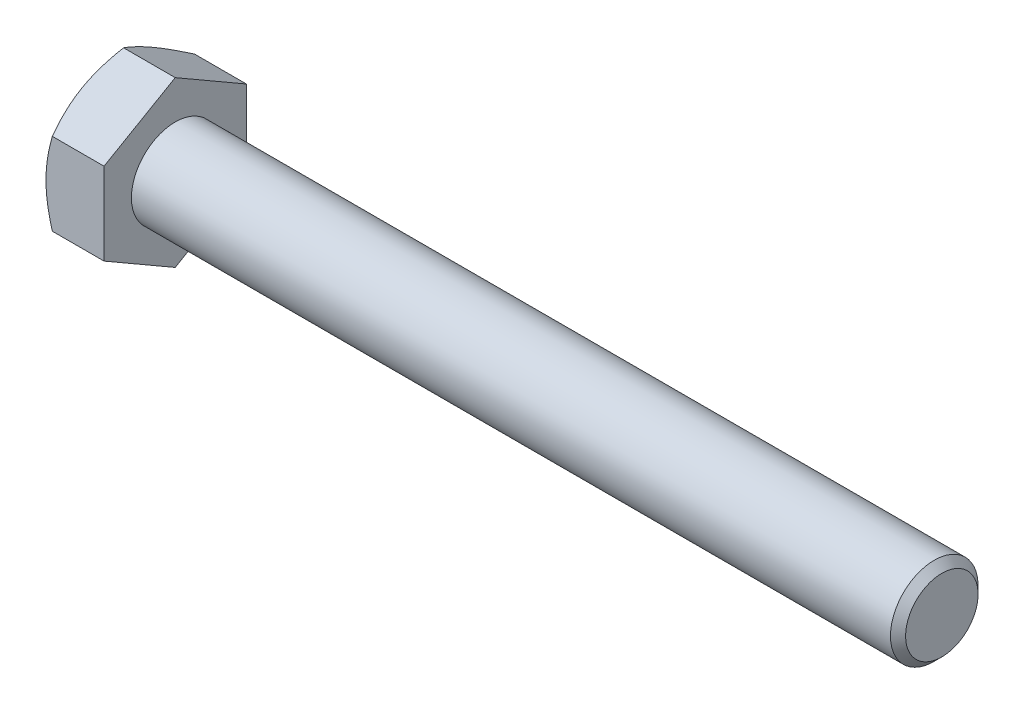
ISO-10303-21;
HEADER;
FILE_DESCRIPTION(('STEP AP214'),'2;1');
FILE_NAME('part.step','',(''),(''),'','','');
FILE_SCHEMA(('AUTOMOTIVE_DESIGN { 1 0 10303 214 1 1 1 1 }'));
ENDSEC;
DATA;
#1=APPLICATION_CONTEXT('core data for automotive mechanical design processes');
#2=APPLICATION_PROTOCOL_DEFINITION('international standard','automotive_design',2000,#1);
#3=PRODUCT_CONTEXT('',#1,'mechanical');
#4=PRODUCT('Part','Part','',(#3));
#5=PRODUCT_RELATED_PRODUCT_CATEGORY('part','',(#4));
#6=PRODUCT_DEFINITION_FORMATION('','',#4);
#7=PRODUCT_DEFINITION_CONTEXT('part definition',#1,'design');
#8=PRODUCT_DEFINITION('design','',#6,#7);
#9=PRODUCT_DEFINITION_SHAPE('','',#8);
#10=(LENGTH_UNIT() NAMED_UNIT(*) SI_UNIT(.MILLI.,.METRE.));
#11=(NAMED_UNIT(*) PLANE_ANGLE_UNIT() SI_UNIT($,.RADIAN.));
#12=(NAMED_UNIT(*) SI_UNIT($,.STERADIAN.) SOLID_ANGLE_UNIT());
#13=UNCERTAINTY_MEASURE_WITH_UNIT(LENGTH_MEASURE(1.E-05),#10,'distance_accuracy_value','');
#14=(GEOMETRIC_REPRESENTATION_CONTEXT(3) GLOBAL_UNCERTAINTY_ASSIGNED_CONTEXT((#13)) GLOBAL_UNIT_ASSIGNED_CONTEXT((#10,
#11,#12)) REPRESENTATION_CONTEXT('',''));
#15=CARTESIAN_POINT('',(0.,0.,0.));
#16=DIRECTION('',(0.,0.,1.));
#17=DIRECTION('',(1.,0.,0.));
#18=AXIS2_PLACEMENT_3D('',#15,#16,#17);
#19=CARTESIAN_POINT('',(5.3,3.75277674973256,-6.5));
#20=DIRECTION('',(0.,-0.866025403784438,0.500000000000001));
#21=DIRECTION('',(0.,-0.500000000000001,-0.866025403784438));
#22=AXIS2_PLACEMENT_3D('',#19,#20,#21);
#23=PLANE('',#22);
#24=CARTESIAN_POINT('',(0.580623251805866,7.50566896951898,0.0002));
#25=CARTESIAN_POINT('',(0.533004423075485,7.4231786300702,-0.14267745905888));
#26=CARTESIAN_POINT('',(0.487546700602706,7.34038072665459,-0.286087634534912));
#27=CARTESIAN_POINT('',(0.401548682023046,7.17411251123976,-0.574072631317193));
#28=CARTESIAN_POINT('',(0.361010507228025,7.09064192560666,-0.718647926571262));
#29=CARTESIAN_POINT('',(0.247571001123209,6.83889369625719,-1.15468865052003));
#30=CARTESIAN_POINT('',(0.183047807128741,6.66962231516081,-1.44787528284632));
#31=CARTESIAN_POINT('',(0.107386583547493,6.41631077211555,-1.88662374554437));
#32=CARTESIAN_POINT('',(0.085832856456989,6.33302748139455,-2.03087463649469));
#33=CARTESIAN_POINT('',(0.0496903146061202,6.16608458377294,-2.32002821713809));
#34=CARTESIAN_POINT('',(0.0351008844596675,6.08242501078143,-2.46493084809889));
#35=CARTESIAN_POINT('',(0.0132587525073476,5.91496056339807,-2.75498777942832));
#36=CARTESIAN_POINT('',(0.00599772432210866,5.8311559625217,-2.90014160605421));
#37=CARTESIAN_POINT('',(-0.00103969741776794,5.66347396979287,-3.19057533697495));
#38=CARTESIAN_POINT('',(-0.000816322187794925,5.5795965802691,-3.33585523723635));
#39=CARTESIAN_POINT('',(0.010083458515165,5.34979921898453,-3.73387594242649));
#40=CARTESIAN_POINT('',(0.0283818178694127,5.20395446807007,-3.98648646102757));
#41=CARTESIAN_POINT('',(0.0864063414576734,4.91323365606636,-4.49002967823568));
#42=CARTESIAN_POINT('',(0.126152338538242,4.76835861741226,-4.74096060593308));
#43=CARTESIAN_POINT('',(0.225505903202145,4.47705272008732,-5.24551722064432));
#44=CARTESIAN_POINT('',(0.285534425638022,4.33065861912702,-5.49907924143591));
#45=CARTESIAN_POINT('',(0.421774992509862,4.04005357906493,-6.00242193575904));
#46=CARTESIAN_POINT('',(0.497955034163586,3.89583891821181,-6.25220905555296));
#47=CARTESIAN_POINT('',(0.58062325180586,3.75266127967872,-6.5002));
#48=B_SPLINE_CURVE_WITH_KNOTS('',3,(#24,#25,#26,#27,#28,#29,#30,#31,#32,#33,#34,#35,#36,#37,#38,
#39,#40,#41,#42,#43,#44,#45,#46,#47),.UNSPECIFIED.,.F.,.F.,(4,2,2,2,2,2,2,2,2,2,2,4),(0.,
0.515105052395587,1.03043143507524,2.06322554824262,2.56697389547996,3.07067772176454,
3.57380860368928,4.0769239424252,4.9527935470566,5.82947446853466,6.72559912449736,
7.61996451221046),.UNSPECIFIED.);
#49=CARTESIAN_POINT('',(0.580556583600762,7.50555349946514,0.));
#50=VERTEX_POINT('',#49);
#51=CARTESIAN_POINT('',(0.,5.62916512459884,-3.25000000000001));
#52=VERTEX_POINT('',#51);
#53=EDGE_CURVE('E54',#50,#52,#48,.T.);
#54=ORIENTED_EDGE('',*,*,#53,.F.);
#55=DIRECTION('',(-1.,0.,0.));
#56=VECTOR('',#55,1.);
#57=CARTESIAN_POINT('',(5.3,7.50555349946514,0.));
#58=LINE('',#57,#56);
#59=CARTESIAN_POINT('',(5.3,7.50555349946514,0.));
#60=VERTEX_POINT('',#59);
#61=EDGE_CURVE('E150',#60,#50,#58,.T.);
#62=ORIENTED_EDGE('',*,*,#61,.F.);
#63=DIRECTION('',(0.,0.500000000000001,0.866025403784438));
#64=VECTOR('',#63,1.);
#65=CARTESIAN_POINT('',(5.3,3.75277674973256,-6.5));
#66=LINE('',#65,#64);
#67=CARTESIAN_POINT('',(5.3,3.75277674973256,-6.5));
#68=VERTEX_POINT('',#67);
#69=EDGE_CURVE('E235',#68,#60,#66,.T.);
#70=ORIENTED_EDGE('',*,*,#69,.F.);
#71=DIRECTION('',(-1.,0.,0.));
#72=VECTOR('',#71,1.);
#73=CARTESIAN_POINT('',(5.3,3.75277674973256,-6.5));
#74=LINE('',#73,#72);
#75=CARTESIAN_POINT('',(0.580556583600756,3.75277674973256,-6.5));
#76=VERTEX_POINT('',#75);
#77=EDGE_CURVE('E138',#68,#76,#74,.T.);
#78=ORIENTED_EDGE('',*,*,#77,.T.);
#79=EDGE_CURVE('E132',#52,#76,#48,.T.);
#80=ORIENTED_EDGE('',*,*,#79,.F.);
#81=EDGE_LOOP('',(#54,#62,#70,#78,#80));
#82=FACE_BOUND('',#81,.T.);
#83=ADVANCED_FACE('F38',(#82),#23,.F.);
#84=CARTESIAN_POINT('',(5.3,7.50555349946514,0.));
#85=DIRECTION('',(0.,-0.866025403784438,-0.500000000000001));
#86=DIRECTION('',(0.,0.500000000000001,-0.866025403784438));
#87=AXIS2_PLACEMENT_3D('',#84,#85,#86);
#88=PLANE('',#87);
#89=CARTESIAN_POINT('',(0.580623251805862,3.75266127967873,6.5002));
#90=CARTESIAN_POINT('',(0.53300442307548,3.83515161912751,6.35732254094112));
#91=CARTESIAN_POINT('',(0.487546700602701,3.91794952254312,6.21391236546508));
#92=CARTESIAN_POINT('',(0.401548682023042,4.08421773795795,5.9259273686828));
#93=CARTESIAN_POINT('',(0.361010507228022,4.16768832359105,5.78135207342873));
#94=CARTESIAN_POINT('',(0.247571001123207,4.41943655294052,5.34531134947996));
#95=CARTESIAN_POINT('',(0.183047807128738,4.5887079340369,5.05212471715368));
#96=CARTESIAN_POINT('',(0.107386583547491,4.84201947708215,4.61337625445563));
#97=CARTESIAN_POINT('',(0.085832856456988,4.92530276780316,4.46912536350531));
#98=CARTESIAN_POINT('',(0.0496903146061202,5.09224566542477,4.17997178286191));
#99=CARTESIAN_POINT('',(0.035100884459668,5.17590523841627,4.03506915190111));
#100=CARTESIAN_POINT('',(0.0132587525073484,5.34336968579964,3.74501222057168));
#101=CARTESIAN_POINT('',(0.00599772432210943,5.427174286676,3.59985839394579));
#102=CARTESIAN_POINT('',(-0.00103969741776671,5.59485627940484,3.30942466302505));
#103=CARTESIAN_POINT('',(-0.000816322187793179,5.6787336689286,3.16414476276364));
#104=CARTESIAN_POINT('',(0.0100834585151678,5.90853103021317,2.76612405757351));
#105=CARTESIAN_POINT('',(0.0283818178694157,6.05437578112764,2.51351353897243));
#106=CARTESIAN_POINT('',(0.0864063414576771,6.34509659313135,2.00997032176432));
#107=CARTESIAN_POINT('',(0.126152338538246,6.48997163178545,1.75903939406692));
#108=CARTESIAN_POINT('',(0.225505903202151,6.78127752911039,1.25448277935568));
#109=CARTESIAN_POINT('',(0.285534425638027,6.92767163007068,1.00092075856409));
#110=CARTESIAN_POINT('',(0.421774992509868,7.21827667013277,0.497578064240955));
#111=CARTESIAN_POINT('',(0.497955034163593,7.36249133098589,0.247790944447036));
#112=CARTESIAN_POINT('',(0.580623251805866,7.50566896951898,-0.000200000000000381));
#113=B_SPLINE_CURVE_WITH_KNOTS('',3,(#89,#90,#91,#92,#93,#94,#95,#96,#97,#98,#99,#100,#101,#102,
#103,#104,#105,#106,#107,#108,#109,#110,#111,#112),.UNSPECIFIED.,.F.,.F.,(4,2,2,2,2,2,2,2,2,2,2,
4),(0.,0.515105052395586,1.03043143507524,2.06322554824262,2.56697389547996,3.07067772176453,
3.57380860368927,4.07692394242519,4.9527935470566,5.82947446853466,6.72559912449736,
7.61996451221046),.UNSPECIFIED.);
#114=CARTESIAN_POINT('',(0.580556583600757,3.75277674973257,6.5));
#115=VERTEX_POINT('',#114);
#116=CARTESIAN_POINT('',(0.,5.62916512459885,3.25));
#117=VERTEX_POINT('',#116);
#118=EDGE_CURVE('E61',#115,#117,#113,.T.);
#119=ORIENTED_EDGE('',*,*,#118,.F.);
#120=DIRECTION('',(-1.,0.,0.));
#121=VECTOR('',#120,1.);
#122=CARTESIAN_POINT('',(5.3,3.75277674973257,6.5));
#123=LINE('',#122,#121);
#124=CARTESIAN_POINT('',(5.3,3.75277674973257,6.5));
#125=VERTEX_POINT('',#124);
#126=EDGE_CURVE('E148',#125,#115,#123,.T.);
#127=ORIENTED_EDGE('',*,*,#126,.F.);
#128=DIRECTION('',(0.,-0.500000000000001,0.866025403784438));
#129=VECTOR('',#128,1.);
#130=CARTESIAN_POINT('',(5.3,7.50555349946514,0.));
#131=LINE('',#130,#129);
#132=EDGE_CURVE('E233',#60,#125,#131,.T.);
#133=ORIENTED_EDGE('',*,*,#132,.F.);
#134=ORIENTED_EDGE('',*,*,#61,.T.);
#135=EDGE_CURVE('E165',#117,#50,#113,.T.);
#136=ORIENTED_EDGE('',*,*,#135,.F.);
#137=EDGE_LOOP('',(#119,#127,#133,#134,#136));
#138=FACE_BOUND('',#137,.T.);
#139=ADVANCED_FACE('F171',(#138),#88,.F.);
#140=CARTESIAN_POINT('',(5.3,3.75277674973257,6.5));
#141=DIRECTION('',(0.,0.,-1.));
#142=DIRECTION('',(0.,1.,0.));
#143=AXIS2_PLACEMENT_3D('',#140,#141,#142);
#144=PLANE('',#143);
#145=CARTESIAN_POINT('',(3.18835311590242,-10.1137456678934,6.5));
#146=CARTESIAN_POINT('',(3.05034774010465,-9.82952666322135,6.5));
#147=CARTESIAN_POINT('',(2.91365616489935,-9.54465869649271,6.5));
#148=CARTESIAN_POINT('',(2.64363899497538,-8.97327978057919,6.5));
#149=CARTESIAN_POINT('',(2.51031392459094,-8.6867685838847,6.5));
#150=CARTESIAN_POINT('',(2.24710473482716,-8.11029837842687,6.5));
#151=CARTESIAN_POINT('',(2.11724300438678,-7.82032911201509,6.5));
#152=CARTESIAN_POINT('',(1.86279082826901,-7.23809541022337,6.5));
#153=CARTESIAN_POINT('',(1.73820013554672,-6.94583108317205,6.5));
#154=CARTESIAN_POINT('',(1.49176685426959,-6.34906440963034,6.5));
#155=CARTESIAN_POINT('',(1.37014257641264,-6.0444714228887,6.5));
#156=CARTESIAN_POINT('',(1.13601865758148,-5.43173420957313,6.5));
#157=CARTESIAN_POINT('',(1.02352003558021,-5.12358959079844,6.5));
#158=CARTESIAN_POINT('',(0.810575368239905,-4.50382569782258,6.5));
#159=CARTESIAN_POINT('',(0.710105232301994,-4.19221478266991,6.5));
#160=CARTESIAN_POINT('',(0.524420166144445,-3.5645201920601,6.5));
#161=CARTESIAN_POINT('',(0.43920046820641,-3.24843794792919,6.5));
#162=CARTESIAN_POINT('',(0.288524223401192,-2.61335465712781,6.5));
#163=CARTESIAN_POINT('',(0.222961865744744,-2.29437912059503,6.5));
#164=CARTESIAN_POINT('',(0.115312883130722,-1.65238219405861,6.5));
#165=CARTESIAN_POINT('',(0.0732239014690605,-1.32936121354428,6.5));
#166=CARTESIAN_POINT('',(0.030488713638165,-0.84523117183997,6.5));
#167=CARTESIAN_POINT('',(0.0196493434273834,-0.684982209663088,6.5));
#168=CARTESIAN_POINT('',(0.00475298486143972,-0.364162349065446,6.5));
#169=CARTESIAN_POINT('',(0.000695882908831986,-0.203591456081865,6.5));
#170=CARTESIAN_POINT('',(-0.000531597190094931,0.11757743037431,6.5));
#171=CARTESIAN_POINT('',(0.00229809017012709,0.278175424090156,6.5));
#172=CARTESIAN_POINT('',(0.0147726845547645,0.599108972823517,6.5));
#173=CARTESIAN_POINT('',(0.0244179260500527,0.759444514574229,6.5));
#174=CARTESIAN_POINT('',(0.0554961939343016,1.14369946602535,6.5));
#175=CARTESIAN_POINT('',(0.0801030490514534,1.36736763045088,6.5));
#176=CARTESIAN_POINT('',(0.14124653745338,1.8130559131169,6.5));
#177=CARTESIAN_POINT('',(0.177784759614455,2.03507580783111,6.5));
#178=CARTESIAN_POINT('',(0.303360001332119,2.69839633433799,6.5));
#179=CARTESIAN_POINT('',(0.4083358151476,3.13672010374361,6.5));
#180=CARTESIAN_POINT('',(0.590564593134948,3.79232112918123,6.5));
#181=CARTESIAN_POINT('',(0.6563131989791,4.01299150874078,6.5));
#182=CARTESIAN_POINT('',(0.794681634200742,4.45218859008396,6.5));
#183=CARTESIAN_POINT('',(0.867301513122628,4.67071527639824,6.5));
#184=CARTESIAN_POINT('',(1.01824353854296,5.10569490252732,6.5));
#185=CARTESIAN_POINT('',(1.0965638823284,5.32214847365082,6.5));
#186=CARTESIAN_POINT('',(1.25798086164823,5.75325725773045,6.5));
#187=CARTESIAN_POINT('',(1.34107741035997,5.96791250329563,6.5));
#188=CARTESIAN_POINT('',(1.56029019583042,6.51888445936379,6.5));
#189=CARTESIAN_POINT('',(1.69936356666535,6.85402316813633,6.5));
#190=CARTESIAN_POINT('',(1.98501958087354,7.52109583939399,6.5));
#191=CARTESIAN_POINT('',(2.13160288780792,7.85302951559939,6.5));
#192=CARTESIAN_POINT('',(2.43059748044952,8.51437865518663,6.5));
#193=CARTESIAN_POINT('',(2.5830105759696,8.84379329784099,6.5));
#194=CARTESIAN_POINT('',(2.89234869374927,9.5004779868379,6.5));
#195=CARTESIAN_POINT('',(3.04927357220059,9.82774810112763,6.49999999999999));
#196=CARTESIAN_POINT('',(3.36692013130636,10.4809971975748,6.49999999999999));
#197=CARTESIAN_POINT('',(3.52764676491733,10.8069737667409,6.49999999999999));
#198=CARTESIAN_POINT('',(3.85198555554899,11.4574882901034,6.49999999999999));
#199=CARTESIAN_POINT('',(4.01559773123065,11.7820262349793,6.49999999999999));
#200=CARTESIAN_POINT('',(4.50986185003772,12.7537468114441,6.49999999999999));
#201=CARTESIAN_POINT('',(4.84399997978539,13.3991555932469,6.49999999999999));
#202=CARTESIAN_POINT('',(5.48575990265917,14.6239779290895,6.49999999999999));
#203=CARTESIAN_POINT('',(5.79279643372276,15.2036995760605,6.49999999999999));
#204=CARTESIAN_POINT('',(6.41069188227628,16.3611382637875,6.49999999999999));
#205=CARTESIAN_POINT('',(6.72155099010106,16.9388552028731,6.49999999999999));
#206=CARTESIAN_POINT('',(7.34519775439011,18.0910273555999,6.49999999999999));
#207=CARTESIAN_POINT('',(7.6579769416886,18.6654871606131,6.49999999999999));
#208=CARTESIAN_POINT('',(8.28574397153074,19.8131486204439,6.49999999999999));
#209=CARTESIAN_POINT('',(8.60073166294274,20.3863503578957,6.49999999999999));
#210=CARTESIAN_POINT('',(8.91652967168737,20.9591024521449,6.49999999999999));
#211=B_SPLINE_CURVE_WITH_KNOTS('',3,(#145,#146,#147,#148,#149,#150,#151,#152,#153,#154,#155,
#156,#157,#158,#159,#160,#161,#162,#163,#164,#165,#166,#167,#168,#169,#170,#171,#172,#173,#174,
#175,#176,#177,#178,#179,#180,#181,#182,#183,#184,#185,#186,#187,#188,#189,#190,#191,#192,#193,
#194,#195,#196,#197,#198,#199,#200,#201,#202,#203,#204,#205,#206,#207,#208,#209,#210),
.UNSPECIFIED.,.F.,.F.,(4,2,2,2,2,2,2,2,2,2,2,2,2,2,2,2,2,2,2,2,2,2,2,2,2,2,2,2,2,2,2,2,4),(0.,
0.947868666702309,1.89588406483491,2.84900320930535,3.80207763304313,4.78589774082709,
5.76982755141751,6.75175256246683,7.73337005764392,8.70960474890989,9.68574140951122,
10.1674651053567,10.6491807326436,11.1309009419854,11.6126447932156,12.287317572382,
12.9620802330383,14.312318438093,15.0030310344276,15.6937486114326,16.3842486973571,
17.0747362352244,18.1631508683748,19.2516618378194,20.3405135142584,21.429330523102,
22.5196540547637,23.6099846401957,25.7902468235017,27.7582608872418,29.7263733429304,
31.6886408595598,33.6507753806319),.UNSPECIFIED.);
#212=CARTESIAN_POINT('',(0.580556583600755,-3.75277674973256,6.5));
#213=VERTEX_POINT('',#212);
#214=CARTESIAN_POINT('',(0.,0.,6.5));
#215=VERTEX_POINT('',#214);
#216=EDGE_CURVE('E245',#213,#215,#211,.T.);
#217=ORIENTED_EDGE('',*,*,#216,.F.);
#218=DIRECTION('',(-1.,0.,0.));
#219=VECTOR('',#218,1.);
#220=CARTESIAN_POINT('',(5.3,-3.75277674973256,6.5));
#221=LINE('',#220,#219);
#222=CARTESIAN_POINT('',(5.3,-3.75277674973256,6.5));
#223=VERTEX_POINT('',#222);
#224=EDGE_CURVE('E140',#223,#213,#221,.T.);
#225=ORIENTED_EDGE('',*,*,#224,.F.);
#226=DIRECTION('',(0.,-1.,0.));
#227=VECTOR('',#226,1.);
#228=CARTESIAN_POINT('',(5.3,3.75277674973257,6.5));
#229=LINE('',#228,#227);
#230=EDGE_CURVE('E229',#125,#223,#229,.T.);
#231=ORIENTED_EDGE('',*,*,#230,.F.);
#232=ORIENTED_EDGE('',*,*,#126,.T.);
#233=EDGE_CURVE('E187',#215,#115,#211,.T.);
#234=ORIENTED_EDGE('',*,*,#233,.F.);
#235=EDGE_LOOP('',(#217,#225,#231,#232,#234));
#236=FACE_BOUND('',#235,.T.);
#237=ADVANCED_FACE('F251',(#236),#144,.F.);
#238=CARTESIAN_POINT('',(5.3,-7.50555349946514,0.));
#239=DIRECTION('',(0.,0.866025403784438,-0.500000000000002));
#240=DIRECTION('',(0.,0.500000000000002,0.866025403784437));
#241=AXIS2_PLACEMENT_3D('',#238,#239,#240);
#242=PLANE('',#241);
#243=CARTESIAN_POINT('',(0.580623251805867,-7.50566896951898,-0.000200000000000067));
#244=CARTESIAN_POINT('',(0.533004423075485,-7.4231786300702,0.14267745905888));
#245=CARTESIAN_POINT('',(0.487546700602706,-7.34038072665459,0.286087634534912));
#246=CARTESIAN_POINT('',(0.401548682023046,-7.17411251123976,0.574072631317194));
#247=CARTESIAN_POINT('',(0.361010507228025,-7.09064192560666,0.718647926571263));
#248=CARTESIAN_POINT('',(0.247571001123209,-6.83889369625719,1.15468865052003));
#249=CARTESIAN_POINT('',(0.18304780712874,-6.66962231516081,1.44787528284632));
#250=CARTESIAN_POINT('',(0.107386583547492,-6.41631077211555,1.88662374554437));
#251=CARTESIAN_POINT('',(0.0858328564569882,-6.33302748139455,2.03087463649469));
#252=CARTESIAN_POINT('',(0.0496903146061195,-6.16608458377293,2.32002821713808));
#253=CARTESIAN_POINT('',(0.0351008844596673,-6.08242501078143,2.46493084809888));
#254=CARTESIAN_POINT('',(0.0132587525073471,-5.91496056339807,2.75498777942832));
#255=CARTESIAN_POINT('',(0.00599772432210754,-5.8311559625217,2.90014160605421));
#256=CARTESIAN_POINT('',(-0.00103969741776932,-5.66347396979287,3.19057533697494));
#257=CARTESIAN_POINT('',(-0.000816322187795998,-5.5795965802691,3.33585523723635));
#258=CARTESIAN_POINT('',(0.0100834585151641,-5.34979921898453,3.73387594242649));
#259=CARTESIAN_POINT('',(0.0283818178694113,-5.20395446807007,3.98648646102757));
#260=CARTESIAN_POINT('',(0.0864063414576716,-4.91323365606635,4.49002967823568));
#261=CARTESIAN_POINT('',(0.126152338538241,-4.76835861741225,4.74096060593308));
#262=CARTESIAN_POINT('',(0.225505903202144,-4.47705272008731,5.24551722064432));
#263=CARTESIAN_POINT('',(0.285534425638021,-4.33065861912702,5.49907924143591));
#264=CARTESIAN_POINT('',(0.421774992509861,-4.04005357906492,6.00242193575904));
#265=CARTESIAN_POINT('',(0.497955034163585,-3.8958389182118,6.25220905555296));
#266=CARTESIAN_POINT('',(0.580623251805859,-3.75266127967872,6.5002));
#267=B_SPLINE_CURVE_WITH_KNOTS('',3,(#243,#244,#245,#246,#247,#248,#249,#250,#251,#252,#253,
#254,#255,#256,#257,#258,#259,#260,#261,#262,#263,#264,#265,#266),.UNSPECIFIED.,.F.,.F.,(4,2,2,
2,2,2,2,2,2,2,2,4),(0.,0.515105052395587,1.03043143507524,2.06322554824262,2.56697389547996,
3.07067772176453,3.57380860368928,4.0769239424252,4.9527935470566,5.82947446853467,
6.72559912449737,7.61996451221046),.UNSPECIFIED.);
#268=CARTESIAN_POINT('',(0.580556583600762,-7.50555349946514,0.));
#269=VERTEX_POINT('',#268);
#270=CARTESIAN_POINT('',(0.,-5.62916512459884,3.25000000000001));
#271=VERTEX_POINT('',#270);
#272=EDGE_CURVE('E173',#269,#271,#267,.T.);
#273=ORIENTED_EDGE('',*,*,#272,.F.);
#274=DIRECTION('',(-1.,0.,0.));
#275=VECTOR('',#274,1.);
#276=CARTESIAN_POINT('',(5.3,-7.50555349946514,0.));
#277=LINE('',#276,#275);
#278=CARTESIAN_POINT('',(5.3,-7.50555349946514,0.));
#279=VERTEX_POINT('',#278);
#280=EDGE_CURVE('E137',#279,#269,#277,.T.);
#281=ORIENTED_EDGE('',*,*,#280,.F.);
#282=DIRECTION('',(0.,-0.500000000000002,-0.866025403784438));
#283=VECTOR('',#282,1.);
#284=CARTESIAN_POINT('',(5.3,-7.50555349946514,0.));
#285=LINE('',#284,#283);
#286=EDGE_CURVE('E227',#223,#279,#285,.T.);
#287=ORIENTED_EDGE('',*,*,#286,.F.);
#288=ORIENTED_EDGE('',*,*,#224,.T.);
#289=EDGE_CURVE('E175',#271,#213,#267,.T.);
#290=ORIENTED_EDGE('',*,*,#289,.F.);
#291=EDGE_LOOP('',(#273,#281,#287,#288,#290));
#292=FACE_BOUND('',#291,.T.);
#293=ADVANCED_FACE('F223',(#292),#242,.F.);
#294=CARTESIAN_POINT('',(5.3,-3.75277674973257,-6.5));
#295=DIRECTION('',(0.,0.866025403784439,0.5));
#296=DIRECTION('',(0.,-0.5,0.866025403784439));
#297=AXIS2_PLACEMENT_3D('',#294,#295,#296);
#298=PLANE('',#297);
#299=CARTESIAN_POINT('',(0.580623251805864,-3.75266127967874,-6.5002));
#300=CARTESIAN_POINT('',(0.533004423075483,-3.83515161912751,-6.35732254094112));
#301=CARTESIAN_POINT('',(0.487546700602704,-3.91794952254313,-6.21391236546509));
#302=CARTESIAN_POINT('',(0.401548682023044,-4.08421773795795,-5.9259273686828));
#303=CARTESIAN_POINT('',(0.361010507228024,-4.16768832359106,-5.78135207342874));
#304=CARTESIAN_POINT('',(0.247571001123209,-4.41943655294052,-5.34531134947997));
#305=CARTESIAN_POINT('',(0.183047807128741,-4.5887079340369,-5.05212471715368));
#306=CARTESIAN_POINT('',(0.107386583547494,-4.84201947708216,-4.61337625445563));
#307=CARTESIAN_POINT('',(0.08583285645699,-4.92530276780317,-4.46912536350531));
#308=CARTESIAN_POINT('',(0.0496903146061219,-5.09224566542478,-4.17997178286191));
#309=CARTESIAN_POINT('',(0.0351008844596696,-5.17590523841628,-4.03506915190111));
#310=CARTESIAN_POINT('',(0.0132587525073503,-5.34336968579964,-3.74501222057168));
#311=CARTESIAN_POINT('',(0.00599772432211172,-5.427174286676,-3.59985839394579));
#312=CARTESIAN_POINT('',(-0.0010396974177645,-5.59485627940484,-3.30942466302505));
#313=CARTESIAN_POINT('',(-0.000816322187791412,-5.67873366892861,-3.16414476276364));
#314=CARTESIAN_POINT('',(0.0100834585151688,-5.90853103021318,-2.76612405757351));
#315=CARTESIAN_POINT('',(0.0283818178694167,-6.05437578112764,-2.51351353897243));
#316=CARTESIAN_POINT('',(0.0864063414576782,-6.34509659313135,-2.00997032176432));
#317=CARTESIAN_POINT('',(0.126152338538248,-6.48997163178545,-1.75903939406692));
#318=CARTESIAN_POINT('',(0.225505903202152,-6.78127752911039,-1.25448277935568));
#319=CARTESIAN_POINT('',(0.285534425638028,-6.92767163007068,-1.00092075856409));
#320=CARTESIAN_POINT('',(0.421774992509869,-7.21827667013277,-0.497578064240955));
#321=CARTESIAN_POINT('',(0.497955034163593,-7.36249133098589,-0.247790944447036));
#322=CARTESIAN_POINT('',(0.580623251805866,-7.50566896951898,0.000200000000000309));
#323=B_SPLINE_CURVE_WITH_KNOTS('',3,(#299,#300,#301,#302,#303,#304,#305,#306,#307,#308,#309,
#310,#311,#312,#313,#314,#315,#316,#317,#318,#319,#320,#321,#322),.UNSPECIFIED.,.F.,.F.,(4,2,2,
2,2,2,2,2,2,2,2,4),(0.,0.515105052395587,1.03043143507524,2.06322554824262,2.56697389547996,
3.07067772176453,3.57380860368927,4.0769239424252,4.9527935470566,5.82947446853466,
6.72559912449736,7.61996451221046),.UNSPECIFIED.);
#324=CARTESIAN_POINT('',(0.58055658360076,-3.75277674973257,-6.5));
#325=VERTEX_POINT('',#324);
#326=CARTESIAN_POINT('',(0.,-5.62916512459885,-3.25));
#327=VERTEX_POINT('',#326);
#328=EDGE_CURVE('E114',#325,#327,#323,.T.);
#329=ORIENTED_EDGE('',*,*,#328,.F.);
#330=DIRECTION('',(-1.,0.,0.));
#331=VECTOR('',#330,1.);
#332=CARTESIAN_POINT('',(5.3,-3.75277674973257,-6.5));
#333=LINE('',#332,#331);
#334=CARTESIAN_POINT('',(5.3,-3.75277674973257,-6.5));
#335=VERTEX_POINT('',#334);
#336=EDGE_CURVE('E128',#335,#325,#333,.T.);
#337=ORIENTED_EDGE('',*,*,#336,.F.);
#338=DIRECTION('',(0.,0.5,-0.866025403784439));
#339=VECTOR('',#338,1.);
#340=CARTESIAN_POINT('',(5.3,-3.75277674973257,-6.5));
#341=LINE('',#340,#339);
#342=EDGE_CURVE('E225',#279,#335,#341,.T.);
#343=ORIENTED_EDGE('',*,*,#342,.F.);
#344=ORIENTED_EDGE('',*,*,#280,.T.);
#345=EDGE_CURVE('E131',#327,#269,#323,.T.);
#346=ORIENTED_EDGE('',*,*,#345,.F.);
#347=EDGE_LOOP('',(#329,#337,#343,#344,#346));
#348=FACE_BOUND('',#347,.T.);
#349=ADVANCED_FACE('F126',(#348),#298,.F.);
#350=CARTESIAN_POINT('',(5.3,3.75277674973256,-6.5));
#351=DIRECTION('',(0.,0.,1.));
#352=DIRECTION('',(0.,-1.,0.));
#353=AXIS2_PLACEMENT_3D('',#350,#351,#352);
#354=PLANE('',#353);
#355=CARTESIAN_POINT('',(3.18835311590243,-10.1137456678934,-6.5));
#356=CARTESIAN_POINT('',(3.05034774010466,-9.82952666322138,-6.5));
#357=CARTESIAN_POINT('',(2.91365616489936,-9.54465869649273,-6.5));
#358=CARTESIAN_POINT('',(2.64363899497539,-8.97327978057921,-6.5));
#359=CARTESIAN_POINT('',(2.51031392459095,-8.68676858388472,-6.5));
#360=CARTESIAN_POINT('',(2.24710473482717,-8.11029837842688,-6.5));
#361=CARTESIAN_POINT('',(2.11724300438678,-7.82032911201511,-6.5));
#362=CARTESIAN_POINT('',(1.86279082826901,-7.23809541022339,-6.5));
#363=CARTESIAN_POINT('',(1.73820013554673,-6.94583108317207,-6.5));
#364=CARTESIAN_POINT('',(1.4917668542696,-6.34906440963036,-6.5));
#365=CARTESIAN_POINT('',(1.37014257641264,-6.04447142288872,-6.5));
#366=CARTESIAN_POINT('',(1.13601865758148,-5.43173420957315,-6.5));
#367=CARTESIAN_POINT('',(1.02352003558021,-5.12358959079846,-6.5));
#368=CARTESIAN_POINT('',(0.81057536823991,-4.50382569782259,-6.5));
#369=CARTESIAN_POINT('',(0.710105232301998,-4.19221478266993,-6.5));
#370=CARTESIAN_POINT('',(0.524420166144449,-3.56452019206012,-6.5));
#371=CARTESIAN_POINT('',(0.439200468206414,-3.2484379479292,-6.5));
#372=CARTESIAN_POINT('',(0.288524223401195,-2.61335465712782,-6.5));
#373=CARTESIAN_POINT('',(0.222961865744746,-2.29437912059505,-6.5));
#374=CARTESIAN_POINT('',(0.115312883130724,-1.65238219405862,-6.5));
#375=CARTESIAN_POINT('',(0.0732239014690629,-1.3293612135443,-6.5));
#376=CARTESIAN_POINT('',(0.0304887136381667,-0.845231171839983,-6.5));
#377=CARTESIAN_POINT('',(0.0196493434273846,-0.684982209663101,-6.5));
#378=CARTESIAN_POINT('',(0.00475298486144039,-0.36416234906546,-6.5));
#379=CARTESIAN_POINT('',(0.000695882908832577,-0.203591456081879,-6.5));
#380=CARTESIAN_POINT('',(-0.000531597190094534,0.117577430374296,-6.5));
#381=CARTESIAN_POINT('',(0.0022980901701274,0.278175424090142,-6.5));
#382=CARTESIAN_POINT('',(0.0147726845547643,0.599108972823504,-6.5));
#383=CARTESIAN_POINT('',(0.0244179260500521,0.759444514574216,-6.5));
#384=CARTESIAN_POINT('',(0.0554961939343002,1.14369946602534,-6.5));
#385=CARTESIAN_POINT('',(0.0801030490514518,1.36736763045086,-6.5));
#386=CARTESIAN_POINT('',(0.141246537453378,1.81305591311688,-6.5));
#387=CARTESIAN_POINT('',(0.177784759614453,2.03507580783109,-6.5));
#388=CARTESIAN_POINT('',(0.303360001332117,2.69839633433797,-6.5));
#389=CARTESIAN_POINT('',(0.408335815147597,3.13672010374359,-6.5));
#390=CARTESIAN_POINT('',(0.590564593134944,3.79232112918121,-6.5));
#391=CARTESIAN_POINT('',(0.656313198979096,4.01299150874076,-6.5));
#392=CARTESIAN_POINT('',(0.794681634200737,4.45218859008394,-6.5));
#393=CARTESIAN_POINT('',(0.867301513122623,4.67071527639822,-6.5));
#394=CARTESIAN_POINT('',(1.01824353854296,5.1056949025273,-6.5));
#395=CARTESIAN_POINT('',(1.0965638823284,5.3221484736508,-6.5));
#396=CARTESIAN_POINT('',(1.25798086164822,5.75325725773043,-6.5));
#397=CARTESIAN_POINT('',(1.34107741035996,5.96791250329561,-6.5));
#398=CARTESIAN_POINT('',(1.56029019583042,6.51888445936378,-6.5));
#399=CARTESIAN_POINT('',(1.69936356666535,6.85402316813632,-6.5));
#400=CARTESIAN_POINT('',(1.98501958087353,7.52109583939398,-6.5));
#401=CARTESIAN_POINT('',(2.13160288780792,7.85302951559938,-6.5));
#402=CARTESIAN_POINT('',(2.43059748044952,8.51437865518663,-6.5));
#403=CARTESIAN_POINT('',(2.58301057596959,8.84379329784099,-6.5));
#404=CARTESIAN_POINT('',(2.89234869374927,9.50047798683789,-6.5));
#405=CARTESIAN_POINT('',(3.04927357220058,9.82774810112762,-6.5));
#406=CARTESIAN_POINT('',(3.36692013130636,10.4809971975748,-6.5));
#407=CARTESIAN_POINT('',(3.52764676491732,10.8069737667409,-6.5));
#408=CARTESIAN_POINT('',(3.85198555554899,11.4574882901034,-6.5));
#409=CARTESIAN_POINT('',(4.01559773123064,11.7820262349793,-6.5));
#410=CARTESIAN_POINT('',(4.50986185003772,12.7537468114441,-6.5));
#411=CARTESIAN_POINT('',(4.84399997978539,13.3991555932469,-6.5));
#412=CARTESIAN_POINT('',(5.48575990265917,14.6239779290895,-6.5));
#413=CARTESIAN_POINT('',(5.79279643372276,15.2036995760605,-6.5));
#414=CARTESIAN_POINT('',(6.41069188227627,16.3611382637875,-6.5));
#415=CARTESIAN_POINT('',(6.72155099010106,16.9388552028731,-6.5));
#416=CARTESIAN_POINT('',(7.34519775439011,18.0910273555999,-6.5));
#417=CARTESIAN_POINT('',(7.6579769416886,18.6654871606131,-6.5));
#418=CARTESIAN_POINT('',(8.28574397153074,19.8131486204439,-6.5));
#419=CARTESIAN_POINT('',(8.60073166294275,20.3863503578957,-6.5));
#420=CARTESIAN_POINT('',(8.91652967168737,20.9591024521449,-6.5));
#421=B_SPLINE_CURVE_WITH_KNOTS('',3,(#355,#356,#357,#358,#359,#360,#361,#362,#363,#364,#365,
#366,#367,#368,#369,#370,#371,#372,#373,#374,#375,#376,#377,#378,#379,#380,#381,#382,#383,#384,
#385,#386,#387,#388,#389,#390,#391,#392,#393,#394,#395,#396,#397,#398,#399,#400,#401,#402,#403,
#404,#405,#406,#407,#408,#409,#410,#411,#412,#413,#414,#415,#416,#417,#418,#419,#420),
.UNSPECIFIED.,.F.,.F.,(4,2,2,2,2,2,2,2,2,2,2,2,2,2,2,2,2,2,2,2,2,2,2,2,2,2,2,2,2,2,2,2,4),(0.,
0.947868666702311,1.89588406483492,2.84900320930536,3.80207763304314,4.7858977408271,
5.76982755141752,6.75175256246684,7.73337005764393,8.7096047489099,9.68574140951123,
10.1674651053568,10.6491807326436,11.1309009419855,11.6126447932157,12.287317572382,
12.9620802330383,14.312318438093,15.0030310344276,15.6937486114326,16.3842486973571,
17.0747362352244,18.1631508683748,19.2516618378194,20.3405135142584,21.429330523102,
22.5196540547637,23.6099846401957,25.7902468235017,27.7582608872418,29.7263733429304,
31.6886408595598,33.6507753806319),.UNSPECIFIED.);
#422=CARTESIAN_POINT('',(0.,0.,-6.5));
#423=VERTEX_POINT('',#422);
#424=EDGE_CURVE('E120',#76,#423,#421,.F.);
#425=ORIENTED_EDGE('',*,*,#424,.F.);
#426=ORIENTED_EDGE('',*,*,#77,.F.);
#427=DIRECTION('',(0.,1.,0.));
#428=VECTOR('',#427,1.);
#429=CARTESIAN_POINT('',(5.3,3.75277674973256,-6.5));
#430=LINE('',#429,#428);
#431=EDGE_CURVE('E136',#335,#68,#430,.T.);
#432=ORIENTED_EDGE('',*,*,#431,.F.);
#433=ORIENTED_EDGE('',*,*,#336,.T.);
#434=EDGE_CURVE('E111',#423,#325,#421,.F.);
#435=ORIENTED_EDGE('',*,*,#434,.F.);
#436=EDGE_LOOP('',(#425,#426,#432,#433,#435));
#437=FACE_BOUND('',#436,.T.);
#438=ADVANCED_FACE('F134',(#437),#354,.F.);
#439=CARTESIAN_POINT('',(5.3,7.50555349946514,0.));
#440=DIRECTION('',(1.,0.,0.));
#441=DIRECTION('',(0.,0.,-1.));
#442=AXIS2_PLACEMENT_3D('',#439,#440,#441);
#443=PLANE('',#442);
#444=ORIENTED_EDGE('',*,*,#69,.T.);
#445=ORIENTED_EDGE('',*,*,#132,.T.);
#446=ORIENTED_EDGE('',*,*,#230,.T.);
#447=ORIENTED_EDGE('',*,*,#286,.T.);
#448=ORIENTED_EDGE('',*,*,#342,.T.);
#449=ORIENTED_EDGE('',*,*,#431,.T.);
#450=EDGE_LOOP('',(#444,#445,#446,#447,#448,#449));
#451=FACE_BOUND('',#450,.T.);
#452=CARTESIAN_POINT('',(5.3,0.,0.));
#453=DIRECTION('',(1.,0.,0.));
#454=DIRECTION('',(0.,0.,-1.));
#455=AXIS2_PLACEMENT_3D('',#452,#453,#454);
#456=CIRCLE('',#455,4.);
#457=CARTESIAN_POINT('',(5.3,0.,-4.));
#458=VERTEX_POINT('',#457);
#459=EDGE_CURVE('E238',#458,#458,#456,.F.);
#460=ORIENTED_EDGE('',*,*,#459,.T.);
#461=EDGE_LOOP('',(#460));
#462=FACE_BOUND('',#461,.T.);
#463=ADVANCED_FACE('F253',(#451,#462),#443,.T.);
#464=CARTESIAN_POINT('',(0.,0.,0.));
#465=DIRECTION('',(-1.,0.,0.));
#466=DIRECTION('',(0.,0.,1.));
#467=AXIS2_PLACEMENT_3D('',#464,#465,#466);
#468=CYLINDRICAL_SURFACE('',#467,4.);
#469=ORIENTED_EDGE('',*,*,#459,.F.);
#470=EDGE_LOOP('',(#469));
#471=FACE_BOUND('',#470,.T.);
#472=CARTESIAN_POINT('',(74.6095,0.,0.));
#473=DIRECTION('',(-1.,0.,0.));
#474=DIRECTION('',(0.,0.,1.));
#475=AXIS2_PLACEMENT_3D('',#472,#473,#474);
#476=CIRCLE('',#475,4.);
#477=CARTESIAN_POINT('',(74.6095,0.,4.));
#478=VERTEX_POINT('',#477);
#479=EDGE_CURVE('E241',#478,#478,#476,.T.);
#480=ORIENTED_EDGE('',*,*,#479,.T.);
#481=EDGE_LOOP('',(#480));
#482=FACE_BOUND('',#481,.T.);
#483=ADVANCED_FACE('F285',(#471,#482),#468,.T.);
#484=CARTESIAN_POINT('',(75.3,0.,0.));
#485=DIRECTION('',(-1.,0.,0.));
#486=DIRECTION('',(0.,0.,1.));
#487=AXIS2_PLACEMENT_3D('',#484,#485,#486);
#488=CONICAL_SURFACE('',#487,3.3095,0.785398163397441);
#489=ORIENTED_EDGE('',*,*,#479,.F.);
#490=EDGE_LOOP('',(#489));
#491=FACE_BOUND('',#490,.T.);
#492=CARTESIAN_POINT('',(75.3,0.,0.));
#493=DIRECTION('',(-1.,0.,0.));
#494=DIRECTION('',(0.,0.,1.));
#495=AXIS2_PLACEMENT_3D('',#492,#493,#494);
#496=CIRCLE('',#495,3.3095);
#497=CARTESIAN_POINT('',(75.3,0.,3.3095));
#498=VERTEX_POINT('',#497);
#499=EDGE_CURVE('E243',#498,#498,#496,.T.);
#500=ORIENTED_EDGE('',*,*,#499,.T.);
#501=EDGE_LOOP('',(#500));
#502=FACE_BOUND('',#501,.T.);
#503=ADVANCED_FACE('F287',(#491,#502),#488,.T.);
#504=CARTESIAN_POINT('',(75.3,0.,0.));
#505=DIRECTION('',(-1.,0.,0.));
#506=DIRECTION('',(0.,0.,1.));
#507=AXIS2_PLACEMENT_3D('',#504,#505,#506);
#508=PLANE('',#507);
#509=ORIENTED_EDGE('',*,*,#499,.F.);
#510=EDGE_LOOP('',(#509));
#511=FACE_BOUND('',#510,.T.);
#512=ADVANCED_FACE('F200',(#511),#508,.F.);
#513=CARTESIAN_POINT('',(0.,0.,0.));
#514=DIRECTION('',(1.,0.,0.));
#515=DIRECTION('',(0.,0.,-1.));
#516=AXIS2_PLACEMENT_3D('',#513,#514,#515);
#517=CONICAL_SURFACE('',#516,6.5,1.0471975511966);
#518=ORIENTED_EDGE('',*,*,#328,.T.);
#519=CARTESIAN_POINT('',(0.,0.,0.));
#520=DIRECTION('',(1.,0.,0.));
#521=DIRECTION('',(0.,0.,-1.));
#522=AXIS2_PLACEMENT_3D('',#519,#520,#521);
#523=CIRCLE('',#522,6.5);
#524=EDGE_CURVE('E42',#327,#423,#523,.T.);
#525=ORIENTED_EDGE('',*,*,#524,.T.);
#526=ORIENTED_EDGE('',*,*,#434,.T.);
#527=EDGE_LOOP('',(#518,#525,#526));
#528=FACE_BOUND('',#527,.T.);
#529=ADVANCED_FACE('F113',(#528),#517,.T.);
#530=ORIENTED_EDGE('',*,*,#272,.T.);
#531=EDGE_CURVE('E155',#271,#327,#523,.T.);
#532=ORIENTED_EDGE('',*,*,#531,.T.);
#533=ORIENTED_EDGE('',*,*,#345,.T.);
#534=EDGE_LOOP('',(#530,#532,#533));
#535=FACE_BOUND('',#534,.T.);
#536=ADVANCED_FACE('F199',(#535),#517,.T.);
#537=ORIENTED_EDGE('',*,*,#216,.T.);
#538=EDGE_CURVE('E156',#215,#271,#523,.T.);
#539=ORIENTED_EDGE('',*,*,#538,.T.);
#540=ORIENTED_EDGE('',*,*,#289,.T.);
#541=EDGE_LOOP('',(#537,#539,#540));
#542=FACE_BOUND('',#541,.T.);
#543=ADVANCED_FACE('F194',(#542),#517,.T.);
#544=ORIENTED_EDGE('',*,*,#233,.T.);
#545=ORIENTED_EDGE('',*,*,#118,.T.);
#546=CARTESIAN_POINT('',(0.,0.,0.));
#547=DIRECTION('',(-1.,0.,0.));
#548=DIRECTION('',(0.,0.,1.));
#549=AXIS2_PLACEMENT_3D('',#546,#547,#548);
#550=CIRCLE('',#549,6.5);
#551=EDGE_CURVE('E121',#215,#117,#550,.T.);
#552=ORIENTED_EDGE('',*,*,#551,.F.);
#553=EDGE_LOOP('',(#544,#545,#552));
#554=FACE_BOUND('',#553,.T.);
#555=ADVANCED_FACE('F198',(#554),#517,.T.);
#556=ORIENTED_EDGE('',*,*,#135,.T.);
#557=ORIENTED_EDGE('',*,*,#53,.T.);
#558=EDGE_CURVE('E47',#52,#117,#523,.T.);
#559=ORIENTED_EDGE('',*,*,#558,.T.);
#560=EDGE_LOOP('',(#556,#557,#559));
#561=FACE_BOUND('',#560,.T.);
#562=ADVANCED_FACE('F164',(#561),#517,.T.);
#563=ORIENTED_EDGE('',*,*,#79,.T.);
#564=ORIENTED_EDGE('',*,*,#424,.T.);
#565=EDGE_CURVE('E11',#423,#52,#523,.T.);
#566=ORIENTED_EDGE('',*,*,#565,.T.);
#567=EDGE_LOOP('',(#563,#564,#566));
#568=FACE_BOUND('',#567,.T.);
#569=ADVANCED_FACE('F257',(#568),#517,.T.);
#570=CARTESIAN_POINT('',(0.,7.50555349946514,0.));
#571=DIRECTION('',(1.,0.,0.));
#572=DIRECTION('',(0.,0.,-1.));
#573=AXIS2_PLACEMENT_3D('',#570,#571,#572);
#574=PLANE('',#573);
#575=ORIENTED_EDGE('',*,*,#565,.F.);
#576=ORIENTED_EDGE('',*,*,#524,.F.);
#577=ORIENTED_EDGE('',*,*,#531,.F.);
#578=ORIENTED_EDGE('',*,*,#538,.F.);
#579=ORIENTED_EDGE('',*,*,#551,.T.);
#580=ORIENTED_EDGE('',*,*,#558,.F.);
#581=EDGE_LOOP('',(#575,#576,#577,#578,#579,#580));
#582=FACE_BOUND('',#581,.T.);
#583=ADVANCED_FACE('F168',(#582),#574,.F.);
#584=CLOSED_SHELL('',(#83,#139,#237,#293,#349,#438,#463,#483,#503,#512,#529,#536,#543,#555,#562,
#569,#583));
#585=MANIFOLD_SOLID_BREP('B2',#584);
#586=ADVANCED_BREP_SHAPE_REPRESENTATION('',(#18,#585),#14);
#587=SHAPE_DEFINITION_REPRESENTATION(#9,#586);
ENDSEC;
END-ISO-10303-21;
